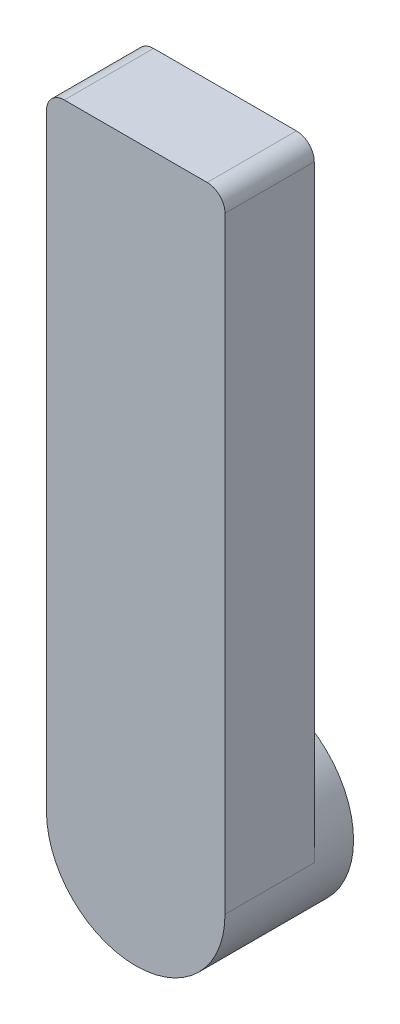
from build123d import *

# Parameters (mm, degrees)
SKETCH1_R                       = 5
BOSS_EXTRUDE1_DEPTH             = 3.6
BOSS_EXTRUDE2_START             = 3.6
SKETCH2_R                       = 5
BOSS_EXTRUDE2_DEPTH             = 3.6
BOSS_EXTRUDE3_REACH             = 16.696
BOSS_EXTRUDE3_END_RADIUS        = 5
SKETCH4_W                       = 10
SKETCH4_H                       = 5
BOSS_EXTRUDE3_DIRECTION_2_DEPTH = 30
FILLET1_R                       = 1


with BuildPart() as part:
    # Sketch1 → Boss-Extrude1 (new body)
    with BuildSketch(Plane.XY):
        with Locations((-5.15, 0)):
            Circle(SKETCH1_R)
        Polygon((-7.072878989, 1.51823463), (-7.034846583, 1.565200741), (-6.89639034, 1.572456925), (-6.903646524, 1.710913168), (-6.860913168, 1.753646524), (-6.722456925, 1.74639034), (-6.715200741, 1.884846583), (-6.66823463, 1.922878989), (-6.531295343, 1.901189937), (-6.50960629, 2.038129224), (-6.458921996, 2.07104399), (-6.325, 2.035159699), (-6.289115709, 2.169081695), (-6.235268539, 2.196518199), (-6.105831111, 2.146831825), (-6.056144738, 2.276269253), (-5.999724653, 2.297926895), (-5.876189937, 2.234982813), (-5.813245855, 2.358517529), (-5.754871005, 2.374159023), (-5.638592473, 2.298646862), (-5.563080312, 2.414925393), (-5.503390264, 2.424379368), (-5.395641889, 2.337126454), (-5.308388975, 2.44487483), (-5.248037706, 2.448037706), (-5.15, 2.35), (-5.051962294, 2.448037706), (-4.991611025, 2.44487483), (-4.904358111, 2.337126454), (-4.796609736, 2.424379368), (-4.736919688, 2.414925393), (-4.661407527, 2.298646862), (-4.545128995, 2.374159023), (-4.486754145, 2.358517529), (-4.423810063, 2.234982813), (-4.300275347, 2.297926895), (-4.243855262, 2.276269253), (-4.194168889, 2.146831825), (-4.064731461, 2.196518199), (-4.010884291, 2.169081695), (-3.975, 2.035159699), (-3.841078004, 2.07104399), (-3.79039371, 2.038129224), (-3.768704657, 1.901189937), (-3.63176537, 1.922878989), (-3.584799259, 1.884846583), (-3.577543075, 1.74639034), (-3.439086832, 1.753646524), (-3.396353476, 1.710913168), (-3.40360966, 1.572456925), (-3.265153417, 1.565200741), (-3.227121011, 1.51823463), (-3.248810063, 1.381295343), (-3.111870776, 1.35960629), (-3.07895601, 1.308921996), (-3.114840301, 1.175), (-2.980918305, 1.139115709), (-2.953481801, 1.085268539), (-3.003168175, 0.955831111), (-2.873730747, 0.906144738), (-2.852073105, 0.849724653), (-2.915017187, 0.726189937), (-2.791482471, 0.663245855), (-2.775840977, 0.604871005), (-2.851353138, 0.488592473), (-2.735074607, 0.413080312), (-2.725620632, 0.353390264), (-2.812873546, 0.245641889), (-2.70512517, 0.158388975), (-2.701962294, 0.098037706), (-2.8, 0), (-2.701962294, -0.098037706), (-2.70512517, -0.158388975), (-2.812873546, -0.245641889), (-2.725620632, -0.353390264), (-2.735074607, -0.413080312), (-2.851353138, -0.488592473), (-2.775840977, -0.604871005), (-2.791482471, -0.663245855), (-2.915017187, -0.726189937), (-2.852073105, -0.849724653), (-2.873730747, -0.906144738), (-3.003168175, -0.955831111), (-2.953481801, -1.085268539), (-2.980918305, -1.139115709), (-3.114840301, -1.175), (-3.07895601, -1.308921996), (-3.111870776, -1.35960629), (-3.248810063, -1.381295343), (-3.227121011, -1.51823463), (-3.265153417, -1.565200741), (-3.40360966, -1.572456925), (-3.396353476, -1.710913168), (-3.439086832, -1.753646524), (-3.577543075, -1.74639034), (-3.584799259, -1.884846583), (-3.63176537, -1.922878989), (-3.768704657, -1.901189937), (-3.79039371, -2.038129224), (-3.841078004, -2.07104399), (-3.975, -2.035159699), (-4.010884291, -2.169081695), (-4.064731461, -2.196518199), (-4.194168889, -2.146831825), (-4.243855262, -2.276269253), (-4.300275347, -2.297926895), (-4.423810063, -2.234982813), (-4.486754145, -2.358517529), (-4.545128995, -2.374159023), (-4.661407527, -2.298646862), (-4.736919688, -2.414925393), (-4.796609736, -2.424379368), (-4.904358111, -2.337126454), (-4.991611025, -2.44487483), (-5.051962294, -2.448037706), (-5.15, -2.35), (-5.248037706, -2.448037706), (-5.308388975, -2.44487483), (-5.395641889, -2.337126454), (-5.503390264, -2.424379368), (-5.563080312, -2.414925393), (-5.638592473, -2.298646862), (-5.754871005, -2.374159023), (-5.813245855, -2.358517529), (-5.876189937, -2.234982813), (-5.999724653, -2.297926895), (-6.056144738, -2.276269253), (-6.105831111, -2.146831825), (-6.235268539, -2.196518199), (-6.289115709, -2.169081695), (-6.325, -2.035159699), (-6.458921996, -2.07104399), (-6.50960629, -2.038129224), (-6.531295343, -1.901189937), (-6.66823463, -1.922878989), (-6.715200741, -1.884846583), (-6.722456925, -1.74639034), (-6.860913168, -1.753646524), (-6.903646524, -1.710913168), (-6.89639034, -1.572456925), (-7.034846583, -1.565200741), (-7.072878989, -1.51823463), (-7.051189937, -1.381295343), (-7.188129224, -1.35960629), (-7.22104399, -1.308921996), (-7.185159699, -1.175), (-7.319081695, -1.139115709), (-7.346518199, -1.085268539), (-7.296831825, -0.955831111), (-7.426269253, -0.906144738), (-7.447926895, -0.849724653), (-7.384982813, -0.726189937), (-7.508517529, -0.663245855), (-7.524159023, -0.604871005), (-7.448646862, -0.488592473), (-7.564925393, -0.413080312), (-7.574379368, -0.353390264), (-7.487126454, -0.245641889), (-7.59487483, -0.158388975), (-7.598037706, -0.098037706), (-7.5, 0), (-7.598037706, 0.098037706), (-7.59487483, 0.158388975), (-7.487126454, 0.245641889), (-7.574379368, 0.353390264), (-7.564925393, 0.413080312), (-7.448646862, 0.488592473), (-7.524159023, 0.604871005), (-7.508517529, 0.663245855), (-7.384982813, 0.726189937), (-7.447926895, 0.849724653), (-7.426269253, 0.906144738), (-7.296831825, 0.955831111), (-7.346518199, 1.085268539), (-7.319081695, 1.139115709), (-7.185159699, 1.175), (-7.22104399, 1.308921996), (-7.188129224, 1.35960629), (-7.051189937, 1.381295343), align=None, mode=Mode.SUBTRACT)
    extrude(amount=-BOSS_EXTRUDE1_DEPTH)

    # Sketch2 → Boss-Extrude2 (add)
    with BuildSketch(Plane.XY.offset(BOSS_EXTRUDE2_START)):
        with Locations((-5.15, 0)):
            Circle(SKETCH2_R)
    extrude(amount=-BOSS_EXTRUDE2_DEPTH)

    # Boss-Extrude3: up to this cylinder (the profile starts outside it)
    boss_extrude3_end = Plane(origin=(-5.15, 0, 1.1), z_dir=(0, 0, 1)) * Cylinder(BOSS_EXTRUDE3_END_RADIUS, 44.392, mode=Mode.PRIVATE)
    # Sketch4 → Boss-Extrude3 (add, up to the surface)
    with BuildSketch(Plane(origin=(0, 5, 0), x_dir=(1, 0, 0), z_dir=(0, 1, 0)), mode=Mode.PRIVATE) as boss_extrude3_sk1:
        with Locations((-5.15, -1.1)):
            Rectangle(SKETCH4_W, SKETCH4_H)
    boss_extrude3_tool1 = extrude(boss_extrude3_sk1.sketch, amount=-BOSS_EXTRUDE3_REACH, mode=Mode.PRIVATE) - boss_extrude3_end
    add(boss_extrude3_tool1.solids().sort_by_distance((-5.15, 5, 1.1))[0])
    add(boss_extrude3_tool1.solids().sort_by_distance((-5.15, 5, 1.1))[1])

    # Sketch4 → Boss-Extrude3 direction 2 (add)
    with BuildSketch(Plane(origin=(0, 5, 0), x_dir=(1, 0, 0), z_dir=(0, 1, 0))):
        with Locations((-5.15, -1.1)):
            Rectangle(SKETCH4_W, SKETCH4_H)
    extrude(amount=BOSS_EXTRUDE3_DIRECTION_2_DEPTH)

    # Fillet1
    fillet1_edges = [part.edges().sort_by_distance(p)[0] for p in [
        (-10.15, 35, 1.1),
        (-0.15, 35, 1.1),
    ]]
    fillet(fillet1_edges, radius=FILLET1_R)


solid = part.part
